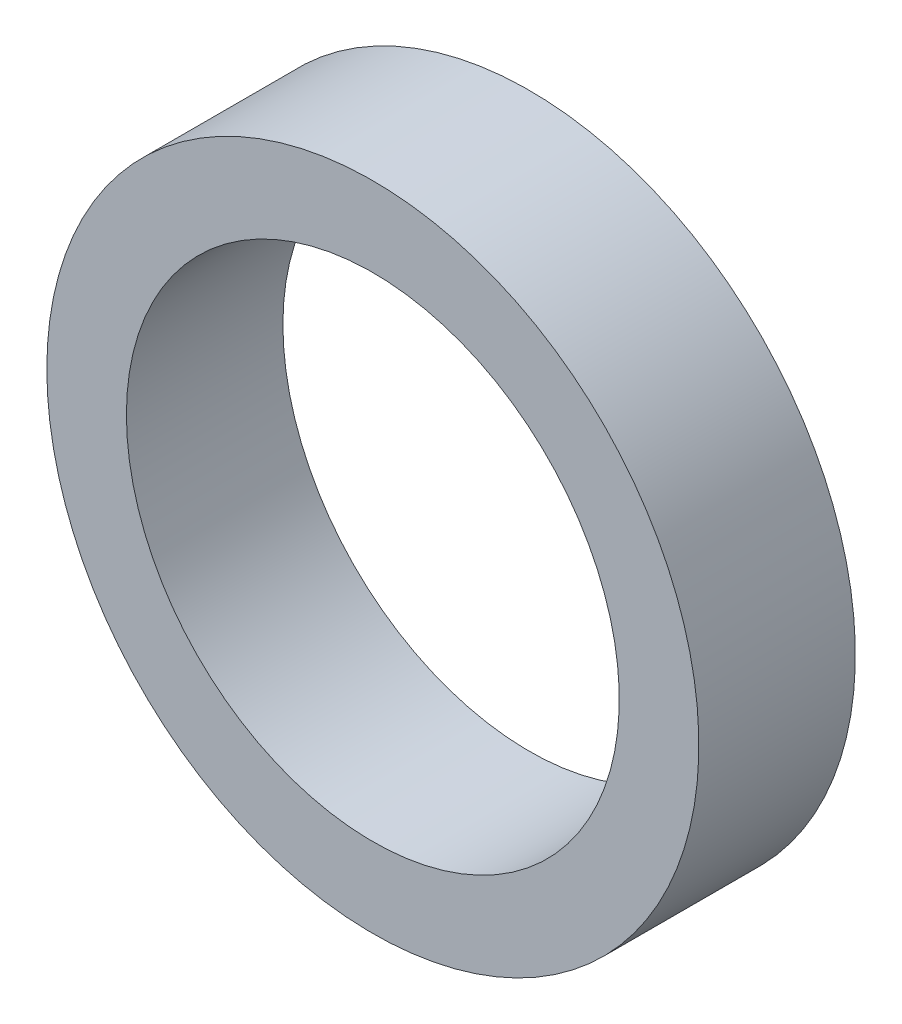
from build123d import *

# Parameters (mm, degrees)
SKETCH1_R           = 7.9375
SKETCH1_R_2         = 6
BOSS_EXTRUDE1_DEPTH = 3.81


with BuildPart() as part:
    # Sketch1 → Boss-Extrude1 (new body)
    with BuildSketch(Plane.XY):
        with Locations(Location((0, 0, 0), (0, 0, 180))):
            Circle(SKETCH1_R)
        with Locations(Location((0, 0, 0), (0, 0, 180))):
            Circle(SKETCH1_R_2, mode=Mode.SUBTRACT)
    extrude(amount=BOSS_EXTRUDE1_DEPTH)


solid = part.part
